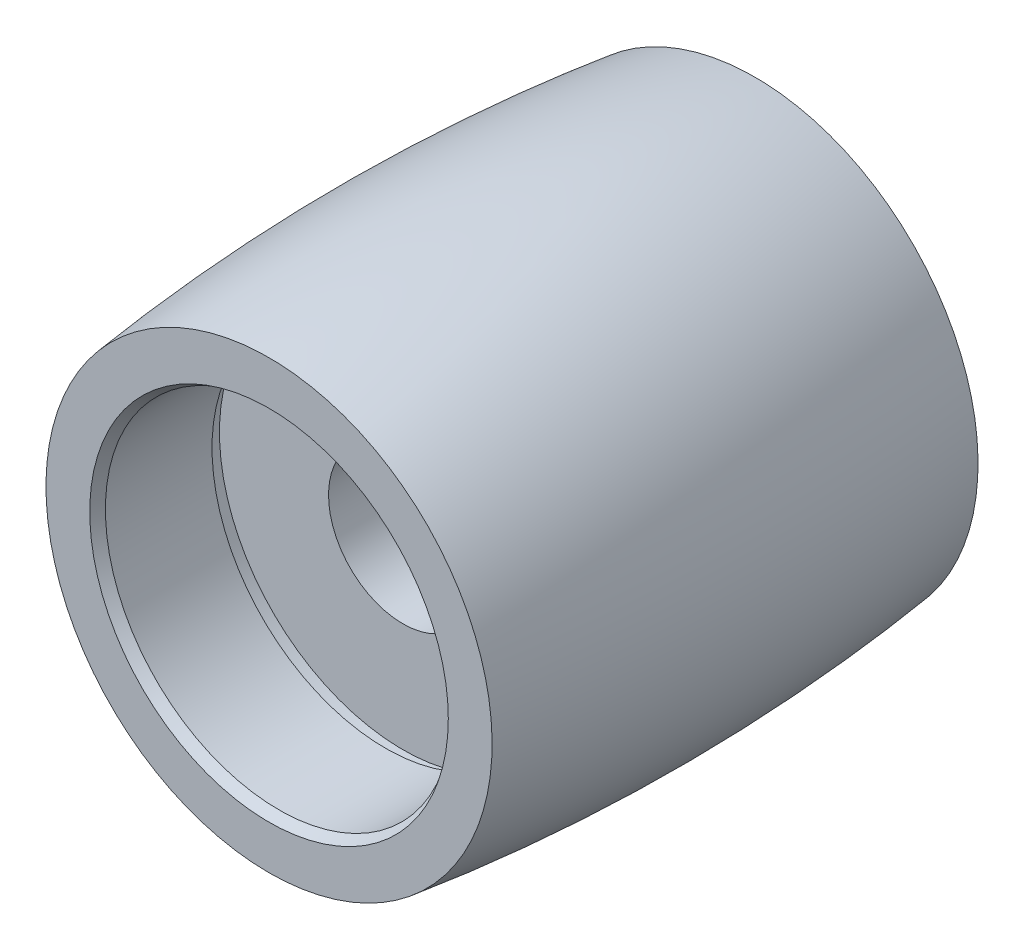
ISO-10303-21;
HEADER;
FILE_DESCRIPTION(('STEP AP214'),'2;1');
FILE_NAME('part.step','',(''),(''),'','','');
FILE_SCHEMA(('AUTOMOTIVE_DESIGN { 1 0 10303 214 1 1 1 1 }'));
ENDSEC;
DATA;
#1=APPLICATION_CONTEXT('core data for automotive mechanical design processes');
#2=APPLICATION_PROTOCOL_DEFINITION('international standard','automotive_design',2000,#1);
#3=PRODUCT_CONTEXT('',#1,'mechanical');
#4=PRODUCT('Part','Part','',(#3));
#5=PRODUCT_RELATED_PRODUCT_CATEGORY('part','',(#4));
#6=PRODUCT_DEFINITION_FORMATION('','',#4);
#7=PRODUCT_DEFINITION_CONTEXT('part definition',#1,'design');
#8=PRODUCT_DEFINITION('design','',#6,#7);
#9=PRODUCT_DEFINITION_SHAPE('','',#8);
#10=(LENGTH_UNIT() NAMED_UNIT(*) SI_UNIT(.MILLI.,.METRE.));
#11=(NAMED_UNIT(*) PLANE_ANGLE_UNIT() SI_UNIT($,.RADIAN.));
#12=(NAMED_UNIT(*) SI_UNIT($,.STERADIAN.) SOLID_ANGLE_UNIT());
#13=UNCERTAINTY_MEASURE_WITH_UNIT(LENGTH_MEASURE(1.E-05),#10,'distance_accuracy_value','');
#14=(GEOMETRIC_REPRESENTATION_CONTEXT(3) GLOBAL_UNCERTAINTY_ASSIGNED_CONTEXT((#13)) GLOBAL_UNIT_ASSIGNED_CONTEXT((#10,
#11,#12)) REPRESENTATION_CONTEXT('',''));
#15=CARTESIAN_POINT('',(0.,0.,0.));
#16=DIRECTION('',(0.,0.,1.));
#17=DIRECTION('',(1.,0.,0.));
#18=AXIS2_PLACEMENT_3D('',#15,#16,#17);
#19=CARTESIAN_POINT('',(0.,0.,12.75));
#20=DIRECTION('',(0.,0.,1.));
#21=DIRECTION('',(1.,0.,0.));
#22=AXIS2_PLACEMENT_3D('',#19,#20,#21);
#23=CYLINDRICAL_SURFACE('',#22,17.5);
#24=CARTESIAN_POINT('',(0.,0.,12.75));
#25=DIRECTION('',(0.,0.,1.));
#26=DIRECTION('',(1.,0.,0.));
#27=AXIS2_PLACEMENT_3D('',#24,#25,#26);
#28=CIRCLE('',#27,17.5);
#29=CARTESIAN_POINT('',(17.5,0.,12.75));
#30=VERTEX_POINT('',#29);
#31=EDGE_CURVE('E16',#30,#30,#28,.F.);
#32=ORIENTED_EDGE('',*,*,#31,.T.);
#33=EDGE_LOOP('',(#32));
#34=FACE_BOUND('',#33,.T.);
#35=CARTESIAN_POINT('',(0.,0.,23.5));
#36=DIRECTION('',(0.,0.,1.));
#37=DIRECTION('',(1.,0.,0.));
#38=AXIS2_PLACEMENT_3D('',#35,#36,#37);
#39=CIRCLE('',#38,17.5);
#40=CARTESIAN_POINT('',(17.5,0.,23.5));
#41=VERTEX_POINT('',#40);
#42=EDGE_CURVE('E28',#41,#41,#39,.T.);
#43=ORIENTED_EDGE('',*,*,#42,.T.);
#44=EDGE_LOOP('',(#43));
#45=FACE_BOUND('',#44,.T.);
#46=ADVANCED_FACE('F12',(#34,#45),#23,.F.);
#47=CARTESIAN_POINT('',(-18.722,-18.786421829,12.75));
#48=DIRECTION('',(0.,0.,1.));
#49=DIRECTION('',(1.,0.,0.));
#50=AXIS2_PLACEMENT_3D('',#47,#48,#49);
#51=PLANE('',#50);
#52=ORIENTED_EDGE('',*,*,#31,.F.);
#53=EDGE_LOOP('',(#52));
#54=FACE_BOUND('',#53,.T.);
#55=CARTESIAN_POINT('',(0.,0.,12.75));
#56=DIRECTION('',(0.,0.,1.));
#57=DIRECTION('',(1.,0.,0.));
#58=AXIS2_PLACEMENT_3D('',#55,#56,#57);
#59=CIRCLE('',#58,18.5);
#60=CARTESIAN_POINT('',(18.5,0.,12.75));
#61=VERTEX_POINT('',#60);
#62=EDGE_CURVE('E30',#61,#61,#59,.F.);
#63=ORIENTED_EDGE('',*,*,#62,.T.);
#64=EDGE_LOOP('',(#63));
#65=FACE_BOUND('',#64,.T.);
#66=ADVANCED_FACE('F54',(#54,#65),#51,.F.);
#67=CARTESIAN_POINT('',(0.,0.,23.5));
#68=DIRECTION('',(0.,0.,1.));
#69=DIRECTION('',(1.,0.,0.));
#70=AXIS2_PLACEMENT_3D('',#67,#68,#69);
#71=CONICAL_SURFACE('',#70,17.5,0.523598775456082);
#72=ORIENTED_EDGE('',*,*,#42,.F.);
#73=EDGE_LOOP('',(#72));
#74=FACE_BOUND('',#73,.T.);
#75=CARTESIAN_POINT('',(0.,0.,24.5));
#76=DIRECTION('',(0.,0.,1.));
#77=DIRECTION('',(1.,0.,0.));
#78=AXIS2_PLACEMENT_3D('',#75,#76,#77);
#79=CIRCLE('',#78,18.077350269);
#80=CARTESIAN_POINT('',(18.077350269,0.,24.5));
#81=VERTEX_POINT('',#80);
#82=EDGE_CURVE('E49',#81,#81,#79,.T.);
#83=ORIENTED_EDGE('',*,*,#82,.T.);
#84=EDGE_LOOP('',(#83));
#85=FACE_BOUND('',#84,.T.);
#86=ADVANCED_FACE('F59',(#74,#85),#71,.F.);
#87=CARTESIAN_POINT('',(0.,0.,11.));
#88=DIRECTION('',(0.,0.,1.));
#89=DIRECTION('',(1.,0.,0.));
#90=AXIS2_PLACEMENT_3D('',#87,#88,#89);
#91=CYLINDRICAL_SURFACE('',#90,18.5);
#92=CARTESIAN_POINT('',(0.,0.,11.));
#93=DIRECTION('',(0.,0.,1.));
#94=DIRECTION('',(1.,0.,0.));
#95=AXIS2_PLACEMENT_3D('',#92,#93,#94);
#96=CIRCLE('',#95,18.5);
#97=CARTESIAN_POINT('',(18.5,0.,11.));
#98=VERTEX_POINT('',#97);
#99=EDGE_CURVE('E46',#98,#98,#96,.F.);
#100=ORIENTED_EDGE('',*,*,#99,.T.);
#101=EDGE_LOOP('',(#100));
#102=FACE_BOUND('',#101,.T.);
#103=ORIENTED_EDGE('',*,*,#62,.F.);
#104=EDGE_LOOP('',(#103));
#105=FACE_BOUND('',#104,.T.);
#106=ADVANCED_FACE('F56',(#102,#105),#91,.F.);
#107=CARTESIAN_POINT('',(22.763627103,-22.841956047,24.5));
#108=DIRECTION('',(0.,0.,-1.));
#109=DIRECTION('',(-1.,0.,0.));
#110=AXIS2_PLACEMENT_3D('',#107,#108,#109);
#111=PLANE('',#110);
#112=ORIENTED_EDGE('',*,*,#82,.F.);
#113=EDGE_LOOP('',(#112));
#114=FACE_BOUND('',#113,.T.);
#115=CARTESIAN_POINT('',(0.,0.,24.5));
#116=DIRECTION('',(0.,0.,1.));
#117=DIRECTION('',(0.,-1.,0.));
#118=AXIS2_PLACEMENT_3D('',#115,#116,#117);
#119=CIRCLE('',#118,22.493702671);
#120=CARTESIAN_POINT('',(0.,-22.493702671,24.5));
#121=VERTEX_POINT('',#120);
#122=EDGE_CURVE('E43',#121,#121,#119,.F.);
#123=ORIENTED_EDGE('',*,*,#122,.F.);
#124=EDGE_LOOP('',(#123));
#125=FACE_BOUND('',#124,.T.);
#126=ADVANCED_FACE('F58',(#114,#125),#111,.F.);
#127=CARTESIAN_POINT('',(18.722,-18.786421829,11.));
#128=DIRECTION('',(0.,0.,-1.));
#129=DIRECTION('',(-1.,0.,0.));
#130=AXIS2_PLACEMENT_3D('',#127,#128,#129);
#131=PLANE('',#130);
#132=CARTESIAN_POINT('',(0.,0.,11.));
#133=DIRECTION('',(0.,0.,1.));
#134=DIRECTION('',(0.,-1.,0.));
#135=AXIS2_PLACEMENT_3D('',#132,#133,#134);
#136=CIRCLE('',#135,7.5);
#137=CARTESIAN_POINT('',(0.,-7.5,11.));
#138=VERTEX_POINT('',#137);
#139=EDGE_CURVE('E40',#138,#138,#136,.F.);
#140=ORIENTED_EDGE('',*,*,#139,.T.);
#141=EDGE_LOOP('',(#140));
#142=FACE_BOUND('',#141,.T.);
#143=ORIENTED_EDGE('',*,*,#99,.F.);
#144=EDGE_LOOP('',(#143));
#145=FACE_BOUND('',#144,.T.);
#146=ADVANCED_FACE('F68',(#142,#145),#131,.F.);
#147=CARTESIAN_POINT('',(0.,0.,0.));
#148=DIRECTION('',(0.,0.,1.));
#149=DIRECTION('',(0.,-1.,0.));
#150=AXIS2_PLACEMENT_3D('',#147,#148,#149);
#151=DEGENERATE_TOROIDAL_SURFACE('',#150,175.999999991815,199.999999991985,.F.);
#152=ORIENTED_EDGE('',*,*,#122,.T.);
#153=EDGE_LOOP('',(#152));
#154=FACE_BOUND('',#153,.T.);
#155=CARTESIAN_POINT('',(0.,0.,-24.5000000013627));
#156=DIRECTION('',(0.,0.,1.));
#157=DIRECTION('',(0.,-1.,0.));
#158=AXIS2_PLACEMENT_3D('',#155,#156,#157);
#159=CIRCLE('',#158,22.4937026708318);
#160=CARTESIAN_POINT('',(0.,-22.4937026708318,-24.5000000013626));
#161=VERTEX_POINT('',#160);
#162=EDGE_CURVE('E37',#161,#161,#159,.T.);
#163=ORIENTED_EDGE('',*,*,#162,.T.);
#164=EDGE_LOOP('',(#163));
#165=FACE_BOUND('',#164,.T.);
#166=ADVANCED_FACE('F93',(#154,#165),#151,.F.);
#167=CARTESIAN_POINT('',(0.,0.,-11.));
#168=DIRECTION('',(0.,0.,1.));
#169=DIRECTION('',(0.,-1.,0.));
#170=AXIS2_PLACEMENT_3D('',#167,#168,#169);
#171=CYLINDRICAL_SURFACE('',#170,7.5);
#172=CARTESIAN_POINT('',(0.,0.,-11.));
#173=DIRECTION('',(0.,0.,1.));
#174=DIRECTION('',(0.,-1.,0.));
#175=AXIS2_PLACEMENT_3D('',#172,#173,#174);
#176=CIRCLE('',#175,7.5);
#177=CARTESIAN_POINT('',(0.,-7.5,-11.));
#178=VERTEX_POINT('',#177);
#179=EDGE_CURVE('E34',#178,#178,#176,.F.);
#180=ORIENTED_EDGE('',*,*,#179,.T.);
#181=EDGE_LOOP('',(#180));
#182=FACE_BOUND('',#181,.T.);
#183=ORIENTED_EDGE('',*,*,#139,.F.);
#184=EDGE_LOOP('',(#183));
#185=FACE_BOUND('',#184,.T.);
#186=ADVANCED_FACE('F96',(#182,#185),#171,.F.);
#187=CARTESIAN_POINT('',(-22.763627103,-22.841956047,-24.5));
#188=DIRECTION('',(0.,0.,1.));
#189=DIRECTION('',(1.,0.,0.));
#190=AXIS2_PLACEMENT_3D('',#187,#188,#189);
#191=PLANE('',#190);
#192=CARTESIAN_POINT('',(0.,0.,-24.5));
#193=DIRECTION('',(0.,0.,-1.));
#194=DIRECTION('',(-1.,0.,0.));
#195=AXIS2_PLACEMENT_3D('',#192,#193,#194);
#196=CIRCLE('',#195,15.);
#197=CARTESIAN_POINT('',(-15.,0.,-24.5));
#198=VERTEX_POINT('',#197);
#199=EDGE_CURVE('E25',#198,#198,#196,.F.);
#200=ORIENTED_EDGE('',*,*,#199,.T.);
#201=EDGE_LOOP('',(#200));
#202=FACE_BOUND('',#201,.T.);
#203=ORIENTED_EDGE('',*,*,#162,.F.);
#204=EDGE_LOOP('',(#203));
#205=FACE_BOUND('',#204,.T.);
#206=ADVANCED_FACE('F98',(#202,#205),#191,.F.);
#207=CARTESIAN_POINT('',(-14.168,-14.216751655,-11.));
#208=DIRECTION('',(0.,0.,1.));
#209=DIRECTION('',(1.,0.,0.));
#210=AXIS2_PLACEMENT_3D('',#207,#208,#209);
#211=PLANE('',#210);
#212=ORIENTED_EDGE('',*,*,#179,.F.);
#213=EDGE_LOOP('',(#212));
#214=FACE_BOUND('',#213,.T.);
#215=CARTESIAN_POINT('',(0.,0.,-11.));
#216=DIRECTION('',(0.,0.,1.));
#217=DIRECTION('',(1.,0.,0.));
#218=AXIS2_PLACEMENT_3D('',#215,#216,#217);
#219=CIRCLE('',#218,14.);
#220=CARTESIAN_POINT('',(14.,0.,-11.));
#221=VERTEX_POINT('',#220);
#222=EDGE_CURVE('E20',#221,#221,#219,.F.);
#223=ORIENTED_EDGE('',*,*,#222,.T.);
#224=EDGE_LOOP('',(#223));
#225=FACE_BOUND('',#224,.T.);
#226=ADVANCED_FACE('F14',(#214,#225),#211,.F.);
#227=CARTESIAN_POINT('',(0.,0.,-23.5));
#228=DIRECTION('',(0.,0.,-1.));
#229=DIRECTION('',(-1.,0.,0.));
#230=AXIS2_PLACEMENT_3D('',#227,#228,#229);
#231=CONICAL_SURFACE('',#230,14.,0.785398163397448);
#232=ORIENTED_EDGE('',*,*,#199,.F.);
#233=EDGE_LOOP('',(#232));
#234=FACE_BOUND('',#233,.T.);
#235=CARTESIAN_POINT('',(0.,0.,-23.5));
#236=DIRECTION('',(0.,0.,1.));
#237=DIRECTION('',(1.,0.,0.));
#238=AXIS2_PLACEMENT_3D('',#235,#236,#237);
#239=CIRCLE('',#238,14.);
#240=CARTESIAN_POINT('',(14.,0.,-23.5));
#241=VERTEX_POINT('',#240);
#242=EDGE_CURVE('E8',#241,#241,#239,.T.);
#243=ORIENTED_EDGE('',*,*,#242,.T.);
#244=EDGE_LOOP('',(#243));
#245=FACE_BOUND('',#244,.T.);
#246=ADVANCED_FACE('F76',(#234,#245),#231,.F.);
#247=CARTESIAN_POINT('',(0.,0.,-23.5));
#248=DIRECTION('',(0.,0.,1.));
#249=DIRECTION('',(1.,0.,0.));
#250=AXIS2_PLACEMENT_3D('',#247,#248,#249);
#251=CYLINDRICAL_SURFACE('',#250,14.);
#252=ORIENTED_EDGE('',*,*,#222,.F.);
#253=EDGE_LOOP('',(#252));
#254=FACE_BOUND('',#253,.T.);
#255=ORIENTED_EDGE('',*,*,#242,.F.);
#256=EDGE_LOOP('',(#255));
#257=FACE_BOUND('',#256,.T.);
#258=ADVANCED_FACE('F74',(#254,#257),#251,.F.);
#259=CLOSED_SHELL('',(#46,#66,#86,#106,#126,#146,#166,#186,#206,#226,#246,#258));
#260=MANIFOLD_SOLID_BREP('B1',#259);
#261=ADVANCED_BREP_SHAPE_REPRESENTATION('',(#18,#260),#14);
#262=SHAPE_DEFINITION_REPRESENTATION(#9,#261);
ENDSEC;
END-ISO-10303-21;
